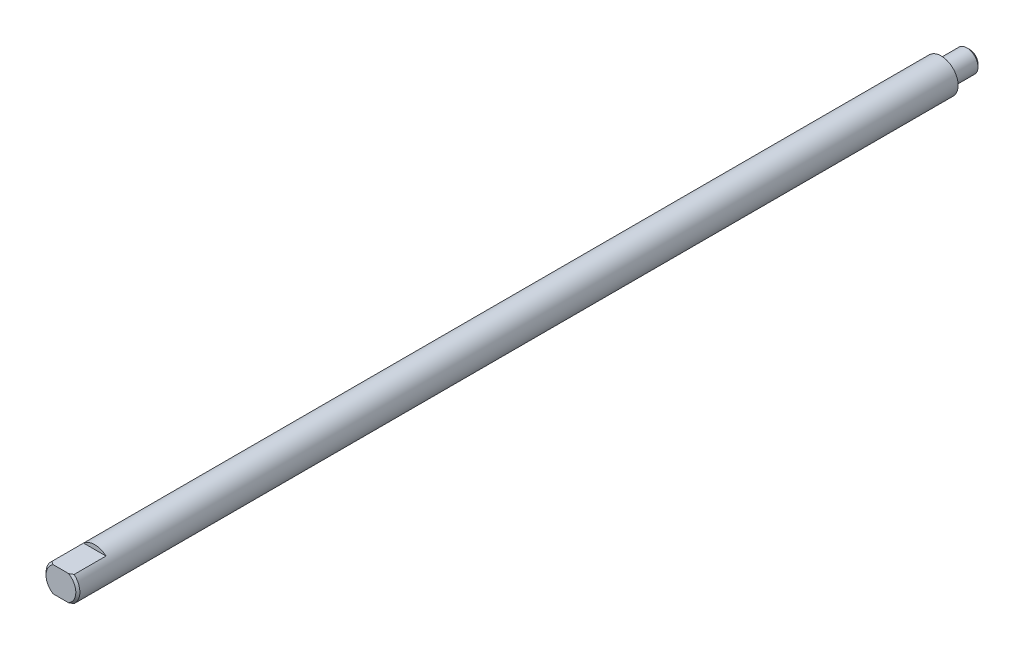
ISO-10303-21;
HEADER;
FILE_DESCRIPTION(('STEP AP214'),'2;1');
FILE_NAME('part.step','',(''),(''),'','','');
FILE_SCHEMA(('AUTOMOTIVE_DESIGN { 1 0 10303 214 1 1 1 1 }'));
ENDSEC;
DATA;
#1=APPLICATION_CONTEXT('core data for automotive mechanical design processes');
#2=APPLICATION_PROTOCOL_DEFINITION('international standard','automotive_design',2000,#1);
#3=PRODUCT_CONTEXT('',#1,'mechanical');
#4=PRODUCT('Part','Part','',(#3));
#5=PRODUCT_RELATED_PRODUCT_CATEGORY('part','',(#4));
#6=PRODUCT_DEFINITION_FORMATION('','',#4);
#7=PRODUCT_DEFINITION_CONTEXT('part definition',#1,'design');
#8=PRODUCT_DEFINITION('design','',#6,#7);
#9=PRODUCT_DEFINITION_SHAPE('','',#8);
#10=(LENGTH_UNIT() NAMED_UNIT(*) SI_UNIT(.MILLI.,.METRE.));
#11=(NAMED_UNIT(*) PLANE_ANGLE_UNIT() SI_UNIT($,.RADIAN.));
#12=(NAMED_UNIT(*) SI_UNIT($,.STERADIAN.) SOLID_ANGLE_UNIT());
#13=UNCERTAINTY_MEASURE_WITH_UNIT(LENGTH_MEASURE(1.E-05),#10,'distance_accuracy_value','');
#14=(GEOMETRIC_REPRESENTATION_CONTEXT(3) GLOBAL_UNCERTAINTY_ASSIGNED_CONTEXT((#13)) GLOBAL_UNIT_ASSIGNED_CONTEXT((#10,
#11,#12)) REPRESENTATION_CONTEXT('',''));
#15=CARTESIAN_POINT('',(0.,0.,0.));
#16=DIRECTION('',(0.,0.,1.));
#17=DIRECTION('',(1.,0.,0.));
#18=AXIS2_PLACEMENT_3D('',#15,#16,#17);
#19=CARTESIAN_POINT('',(0.,0.,3.684));
#20=DIRECTION('',(0.,0.,-1.));
#21=DIRECTION('',(-1.,0.,0.));
#22=AXIS2_PLACEMENT_3D('',#19,#20,#21);
#23=CONICAL_SURFACE('',#22,3.175,0.791934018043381);
#24=CARTESIAN_POINT('',(0.,0.,3.684));
#25=DIRECTION('',(0.,0.,1.));
#26=DIRECTION('',(1.,0.,0.));
#27=AXIS2_PLACEMENT_3D('',#24,#25,#26);
#28=CIRCLE('',#27,3.175);
#29=CARTESIAN_POINT('',(-2.10713075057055,2.375,3.684));
#30=VERTEX_POINT('',#29);
#31=CARTESIAN_POINT('',(-2.10713075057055,-2.375,3.684));
#32=VERTEX_POINT('',#31);
#33=EDGE_CURVE('E105',#30,#32,#28,.T.);
#34=ORIENTED_EDGE('',*,*,#33,.T.);
#35=CARTESIAN_POINT('',(-6.6296694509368,-2.375,-0.13301595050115));
#36=CARTESIAN_POINT('',(-6.41872085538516,-2.375,0.062936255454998));
#37=CARTESIAN_POINT('',(-6.20729327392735,-2.375,0.258380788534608));
#38=CARTESIAN_POINT('',(-5.78286017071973,-2.375,0.647887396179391));
#39=CARTESIAN_POINT('',(-5.56985352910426,-2.375,0.841948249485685));
#40=CARTESIAN_POINT('',(-5.13574053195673,-2.375,1.23363349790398));
#41=CARTESIAN_POINT('',(-4.9145790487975,-2.375,1.43119690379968));
#42=CARTESIAN_POINT('',(-4.46963283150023,-2.375,1.82304516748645));
#43=CARTESIAN_POINT('',(-4.24585006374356,-2.375,2.01733224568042));
#44=CARTESIAN_POINT('',(-3.90719638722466,-2.375,2.30510248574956));
#45=CARTESIAN_POINT('',(-3.79385459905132,-2.375,2.40038380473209));
#46=CARTESIAN_POINT('',(-3.56590809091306,-2.375,2.5894215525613));
#47=CARTESIAN_POINT('',(-3.4513034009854,-2.375,2.68317801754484));
#48=CARTESIAN_POINT('',(-3.22025369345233,-2.375,2.86895465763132));
#49=CARTESIAN_POINT('',(-3.10380502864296,-2.375,2.96097030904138));
#50=CARTESIAN_POINT('',(-2.86892224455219,-2.375,3.14241965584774));
#51=CARTESIAN_POINT('',(-2.75048831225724,-2.375,3.23185359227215));
#52=CARTESIAN_POINT('',(-2.51255729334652,-2.375,3.40617108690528));
#53=CARTESIAN_POINT('',(-2.39309165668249,-2.375,3.49109735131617));
#54=CARTESIAN_POINT('',(-2.15090508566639,-2.375,3.65634247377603));
#55=CARTESIAN_POINT('',(-2.02818269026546,-2.375,3.73665921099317));
#56=CARTESIAN_POINT('',(-1.77912466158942,-2.375,3.8903965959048));
#57=CARTESIAN_POINT('',(-1.65280524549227,-2.375,3.96384327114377));
#58=CARTESIAN_POINT('',(-1.39512518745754,-2.375,4.10119391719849));
#59=CARTESIAN_POINT('',(-1.26377071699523,-2.375,4.16510912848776));
#60=CARTESIAN_POINT('',(-1.05701971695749,-2.375,4.25273595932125));
#61=CARTESIAN_POINT('',(-0.983728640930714,-2.375,4.28140199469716));
#62=CARTESIAN_POINT('',(-0.835356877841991,-2.375,4.3337772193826));
#63=CARTESIAN_POINT('',(-0.760275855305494,-2.375,4.35748547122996));
#64=CARTESIAN_POINT('',(-0.608898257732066,-2.375,4.39885359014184));
#65=CARTESIAN_POINT('',(-0.532610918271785,-2.375,4.41654679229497));
#66=CARTESIAN_POINT('',(-0.378780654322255,-2.375,4.445154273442));
#67=CARTESIAN_POINT('',(-0.301238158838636,-2.375,4.45607082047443));
#68=CARTESIAN_POINT('',(-0.144559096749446,-2.375,4.47054748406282));
#69=CARTESIAN_POINT('',(-0.065414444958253,-2.375,4.47402190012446));
#70=CARTESIAN_POINT('',(0.09282495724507,-2.375,4.47312081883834));
#71=CARTESIAN_POINT('',(0.171919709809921,-2.375,4.4687456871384));
#72=CARTESIAN_POINT('',(0.329626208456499,-2.375,4.45241265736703));
#73=CARTESIAN_POINT('',(0.408234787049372,-2.375,4.44042470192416));
#74=CARTESIAN_POINT('',(0.564086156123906,-2.375,4.40957980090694));
#75=CARTESIAN_POINT('',(0.641328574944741,-2.375,4.39072101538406));
#76=CARTESIAN_POINT('',(0.827865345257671,-2.375,4.33746225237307));
#77=CARTESIAN_POINT('',(0.936246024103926,-2.375,4.29987709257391));
#78=CARTESIAN_POINT('',(1.14927492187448,-2.375,4.21535984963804));
#79=CARTESIAN_POINT('',(1.25392057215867,-2.375,4.16842147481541));
#80=CARTESIAN_POINT('',(1.46087103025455,-2.375,4.06709514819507));
#81=CARTESIAN_POINT('',(1.56313950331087,-2.375,4.01263383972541));
#82=CARTESIAN_POINT('',(1.71427099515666,-2.375,3.92703840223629));
#83=CARTESIAN_POINT('',(1.76426245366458,-2.375,3.89786057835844));
#84=CARTESIAN_POINT('',(1.86356372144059,-2.375,3.83837009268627));
#85=CARTESIAN_POINT('',(1.91287355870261,-2.375,3.80805747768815));
#86=CARTESIAN_POINT('',(2.07522042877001,-2.375,3.7060122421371));
#87=CARTESIAN_POINT('',(2.18692206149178,-2.375,3.63215349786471));
#88=CARTESIAN_POINT('',(2.40772318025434,-2.375,3.48062951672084));
#89=CARTESIAN_POINT('',(2.51682205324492,-2.375,3.40296339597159));
#90=CARTESIAN_POINT('',(2.73301390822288,-2.375,3.24473477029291));
#91=CARTESIAN_POINT('',(2.84010537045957,-2.375,3.16417019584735));
#92=CARTESIAN_POINT('',(3.05261723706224,-2.375,3.00086187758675));
#93=CARTESIAN_POINT('',(3.15803753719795,-2.375,2.91811799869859));
#94=CARTESIAN_POINT('',(3.47300086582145,-2.375,2.66679989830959));
#95=CARTESIAN_POINT('',(3.68051445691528,-2.375,2.49568568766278));
#96=CARTESIAN_POINT('',(4.09182405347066,-2.375,2.14926116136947));
#97=CARTESIAN_POINT('',(4.29562161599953,-2.375,1.97395267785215));
#98=CARTESIAN_POINT('',(4.67931232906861,-2.375,1.63905531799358));
#99=CARTESIAN_POINT('',(4.85946034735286,-2.375,1.47975783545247));
#100=CARTESIAN_POINT('',(5.21824582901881,-2.375,1.15942835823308));
#101=CARTESIAN_POINT('',(5.39688309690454,-2.375,0.998396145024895));
#102=CARTESIAN_POINT('',(5.75173692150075,-2.375,0.676174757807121));
#103=CARTESIAN_POINT('',(5.9279616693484,-2.375,0.514994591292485));
#104=CARTESIAN_POINT('',(6.2794614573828,-2.375,0.19165934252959));
#105=CARTESIAN_POINT('',(6.45473664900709,-2.375,0.0295044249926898));
#106=CARTESIAN_POINT('',(6.6296694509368,-2.375,-0.133015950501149));
#107=B_SPLINE_CURVE_WITH_KNOTS('',3,(#35,#36,#37,#38,#39,#40,#41,#42,#43,#44,#45,#46,#47,#48,
#49,#50,#51,#52,#53,#54,#55,#56,#57,#58,#59,#60,#61,#62,#63,#64,#65,#66,#67,#68,#69,#70,#71,#72,
#73,#74,#75,#76,#77,#78,#79,#80,#81,#82,#83,#84,#85,#86,#87,#88,#89,#90,#91,#92,#93,#94,#95,#96,
#97,#98,#99,#100,#101,#102,#103,#104,#105,#106),.UNSPECIFIED.,.F.,.F.,(4,2,2,2,2,2,2,2,2,2,2,2,
2,2,2,2,2,2,2,2,2,2,2,2,2,2,2,2,2,2,2,2,2,2,2,4),(0.,0.863760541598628,1.72820709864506,
2.61784876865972,3.50686109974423,3.95106286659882,4.39525409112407,4.84047397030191,
5.28565214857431,5.72530383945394,6.16515621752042,6.60326828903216,7.04085953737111,
7.27681206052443,7.51280915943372,7.74747620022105,7.98206465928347,8.21934033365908,
8.45660495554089,8.69481223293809,8.93308334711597,9.2766060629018,9.62036064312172,
9.96774119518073,10.141380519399,10.315012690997,10.7166254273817,11.1183318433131,
11.5203310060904,11.9223551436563,12.7291420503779,13.5355827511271,14.2569976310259,
14.978504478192,15.6949553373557,16.4112883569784),.UNSPECIFIED.);
#108=CARTESIAN_POINT('',(-1.46406113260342,-2.375,4.064));
#109=VERTEX_POINT('',#108);
#110=EDGE_CURVE('E128',#32,#109,#107,.T.);
#111=ORIENTED_EDGE('',*,*,#110,.T.);
#112=CARTESIAN_POINT('',(0.,0.,4.064));
#113=DIRECTION('',(0.,0.,1.));
#114=DIRECTION('',(1.,0.,0.));
#115=AXIS2_PLACEMENT_3D('',#112,#113,#114);
#116=CIRCLE('',#115,2.79);
#117=CARTESIAN_POINT('',(-1.46406113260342,2.375,4.064));
#118=VERTEX_POINT('',#117);
#119=EDGE_CURVE('E115',#118,#109,#116,.T.);
#120=ORIENTED_EDGE('',*,*,#119,.F.);
#121=CARTESIAN_POINT('',(6.6296694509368,2.375,-0.13301595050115));
#122=CARTESIAN_POINT('',(6.41872085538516,2.375,0.0629362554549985));
#123=CARTESIAN_POINT('',(6.20729327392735,2.375,0.258380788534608));
#124=CARTESIAN_POINT('',(5.78286017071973,2.375,0.647887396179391));
#125=CARTESIAN_POINT('',(5.56985352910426,2.375,0.841948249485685));
#126=CARTESIAN_POINT('',(5.13574053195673,2.375,1.23363349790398));
#127=CARTESIAN_POINT('',(4.9145790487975,2.375,1.43119690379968));
#128=CARTESIAN_POINT('',(4.46963283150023,2.375,1.82304516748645));
#129=CARTESIAN_POINT('',(4.24585006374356,2.375,2.01733224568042));
#130=CARTESIAN_POINT('',(3.90719638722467,2.375,2.30510248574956));
#131=CARTESIAN_POINT('',(3.79385459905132,2.375,2.40038380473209));
#132=CARTESIAN_POINT('',(3.56590809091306,2.375,2.5894215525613));
#133=CARTESIAN_POINT('',(3.4513034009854,2.375,2.68317801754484));
#134=CARTESIAN_POINT('',(3.22025369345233,2.375,2.86895465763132));
#135=CARTESIAN_POINT('',(3.10380502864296,2.375,2.96097030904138));
#136=CARTESIAN_POINT('',(2.86892224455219,2.375,3.14241965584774));
#137=CARTESIAN_POINT('',(2.75048831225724,2.375,3.23185359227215));
#138=CARTESIAN_POINT('',(2.51255729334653,2.375,3.40617108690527));
#139=CARTESIAN_POINT('',(2.3930916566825,2.375,3.49109735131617));
#140=CARTESIAN_POINT('',(2.15090508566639,2.375,3.65634247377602));
#141=CARTESIAN_POINT('',(2.02818269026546,2.375,3.73665921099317));
#142=CARTESIAN_POINT('',(1.77912466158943,2.375,3.8903965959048));
#143=CARTESIAN_POINT('',(1.65280524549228,2.375,3.96384327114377));
#144=CARTESIAN_POINT('',(1.39512518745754,2.375,4.10119391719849));
#145=CARTESIAN_POINT('',(1.26377071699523,2.375,4.16510912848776));
#146=CARTESIAN_POINT('',(1.0570197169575,2.375,4.25273595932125));
#147=CARTESIAN_POINT('',(0.983728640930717,2.375,4.28140199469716));
#148=CARTESIAN_POINT('',(0.835356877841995,2.375,4.3337772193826));
#149=CARTESIAN_POINT('',(0.760275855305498,2.375,4.35748547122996));
#150=CARTESIAN_POINT('',(0.608898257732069,2.375,4.39885359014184));
#151=CARTESIAN_POINT('',(0.532610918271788,2.375,4.41654679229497));
#152=CARTESIAN_POINT('',(0.378780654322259,2.375,4.445154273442));
#153=CARTESIAN_POINT('',(0.301238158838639,2.375,4.45607082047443));
#154=CARTESIAN_POINT('',(0.144559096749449,2.375,4.47054748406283));
#155=CARTESIAN_POINT('',(0.0654144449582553,2.375,4.47402190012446));
#156=CARTESIAN_POINT('',(-0.0928249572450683,2.375,4.47312081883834));
#157=CARTESIAN_POINT('',(-0.171919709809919,2.375,4.4687456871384));
#158=CARTESIAN_POINT('',(-0.329626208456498,2.375,4.45241265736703));
#159=CARTESIAN_POINT('',(-0.408234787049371,2.375,4.44042470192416));
#160=CARTESIAN_POINT('',(-0.564086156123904,2.375,4.40957980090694));
#161=CARTESIAN_POINT('',(-0.641328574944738,2.375,4.39072101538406));
#162=CARTESIAN_POINT('',(-0.827865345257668,2.375,4.33746225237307));
#163=CARTESIAN_POINT('',(-0.936246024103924,2.375,4.29987709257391));
#164=CARTESIAN_POINT('',(-1.14927492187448,2.375,4.21535984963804));
#165=CARTESIAN_POINT('',(-1.25392057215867,2.375,4.16842147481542));
#166=CARTESIAN_POINT('',(-1.46087103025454,2.375,4.06709514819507));
#167=CARTESIAN_POINT('',(-1.56313950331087,2.375,4.01263383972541));
#168=CARTESIAN_POINT('',(-1.71427099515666,2.375,3.92703840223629));
#169=CARTESIAN_POINT('',(-1.76426245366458,2.375,3.89786057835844));
#170=CARTESIAN_POINT('',(-1.86356372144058,2.375,3.83837009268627));
#171=CARTESIAN_POINT('',(-1.91287355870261,2.375,3.80805747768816));
#172=CARTESIAN_POINT('',(-2.07522042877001,2.375,3.70601224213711));
#173=CARTESIAN_POINT('',(-2.18692206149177,2.375,3.63215349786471));
#174=CARTESIAN_POINT('',(-2.40772318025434,2.375,3.48062951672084));
#175=CARTESIAN_POINT('',(-2.51682205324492,2.375,3.40296339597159));
#176=CARTESIAN_POINT('',(-2.73301390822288,2.375,3.24473477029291));
#177=CARTESIAN_POINT('',(-2.84010537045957,2.375,3.16417019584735));
#178=CARTESIAN_POINT('',(-3.05261723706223,2.375,3.00086187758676));
#179=CARTESIAN_POINT('',(-3.15803753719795,2.375,2.91811799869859));
#180=CARTESIAN_POINT('',(-3.47300086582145,2.375,2.66679989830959));
#181=CARTESIAN_POINT('',(-3.68051445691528,2.375,2.49568568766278));
#182=CARTESIAN_POINT('',(-4.09182405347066,2.375,2.14926116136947));
#183=CARTESIAN_POINT('',(-4.29562161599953,2.375,1.97395267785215));
#184=CARTESIAN_POINT('',(-4.67931232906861,2.375,1.63905531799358));
#185=CARTESIAN_POINT('',(-4.85946034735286,2.375,1.47975783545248));
#186=CARTESIAN_POINT('',(-5.2182458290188,2.375,1.15942835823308));
#187=CARTESIAN_POINT('',(-5.39688309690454,2.375,0.998396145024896));
#188=CARTESIAN_POINT('',(-5.75173692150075,2.375,0.676174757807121));
#189=CARTESIAN_POINT('',(-5.9279616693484,2.375,0.514994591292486));
#190=CARTESIAN_POINT('',(-6.2794614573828,2.375,0.19165934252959));
#191=CARTESIAN_POINT('',(-6.45473664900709,2.375,0.0295044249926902));
#192=CARTESIAN_POINT('',(-6.6296694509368,2.375,-0.133015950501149));
#193=B_SPLINE_CURVE_WITH_KNOTS('',3,(#121,#122,#123,#124,#125,#126,#127,#128,#129,#130,#131,
#132,#133,#134,#135,#136,#137,#138,#139,#140,#141,#142,#143,#144,#145,#146,#147,#148,#149,#150,
#151,#152,#153,#154,#155,#156,#157,#158,#159,#160,#161,#162,#163,#164,#165,#166,#167,#168,#169,
#170,#171,#172,#173,#174,#175,#176,#177,#178,#179,#180,#181,#182,#183,#184,#185,#186,#187,#188,
#189,#190,#191,#192),.UNSPECIFIED.,.F.,.F.,(4,2,2,2,2,2,2,2,2,2,2,2,2,2,2,2,2,2,2,2,2,2,2,2,2,2,
2,2,2,2,2,2,2,2,2,4),(0.,0.863760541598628,1.72820709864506,2.61784876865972,3.50686109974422,
3.95106286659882,4.39525409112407,4.8404739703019,5.28565214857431,5.72530383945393,
6.16515621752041,6.60326828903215,7.04085953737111,7.27681206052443,7.51280915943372,
7.74747620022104,7.98206465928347,8.21934033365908,8.45660495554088,8.69481223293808,
8.93308334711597,9.2766060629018,9.62036064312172,9.96774119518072,10.141380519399,
10.3150126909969,10.7166254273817,11.1183318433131,11.5203310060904,11.9223551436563,
12.7291420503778,13.5355827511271,14.2569976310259,14.978504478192,15.6949553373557,
16.4112883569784),.UNSPECIFIED.);
#194=EDGE_CURVE('E129',#118,#30,#193,.T.);
#195=ORIENTED_EDGE('',*,*,#194,.T.);
#196=EDGE_LOOP('',(#34,#111,#120,#195));
#197=FACE_BOUND('',#196,.T.);
#198=ADVANCED_FACE('F33',(#197),#23,.T.);
#199=CARTESIAN_POINT('',(0.,0.,4.064));
#200=DIRECTION('',(0.,0.,-1.));
#201=DIRECTION('',(-1.,0.,0.));
#202=AXIS2_PLACEMENT_3D('',#199,#200,#201);
#203=PLANE('',#202);
#204=ORIENTED_EDGE('',*,*,#119,.T.);
#205=DIRECTION('',(1.,0.,0.));
#206=VECTOR('',#205,1.);
#207=CARTESIAN_POINT('',(-5.,-2.375,4.064));
#208=LINE('',#207,#206);
#209=CARTESIAN_POINT('',(1.46406113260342,-2.375,4.064));
#210=VERTEX_POINT('',#209);
#211=EDGE_CURVE('E95',#109,#210,#208,.T.);
#212=ORIENTED_EDGE('',*,*,#211,.T.);
#213=CARTESIAN_POINT('',(1.46406113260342,2.375,4.064));
#214=VERTEX_POINT('',#213);
#215=EDGE_CURVE('E109',#210,#214,#116,.T.);
#216=ORIENTED_EDGE('',*,*,#215,.T.);
#217=DIRECTION('',(1.,0.,0.));
#218=VECTOR('',#217,1.);
#219=CARTESIAN_POINT('',(-5.,2.375,4.064));
#220=LINE('',#219,#218);
#221=EDGE_CURVE('E135',#118,#214,#220,.T.);
#222=ORIENTED_EDGE('',*,*,#221,.F.);
#223=EDGE_LOOP('',(#204,#212,#216,#222));
#224=FACE_BOUND('',#223,.T.);
#225=ADVANCED_FACE('F35',(#224),#203,.F.);
#226=ORIENTED_EDGE('',*,*,#215,.F.);
#227=CARTESIAN_POINT('',(2.10713075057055,-2.375,3.684));
#228=VERTEX_POINT('',#227);
#229=EDGE_CURVE('E94',#210,#228,#107,.T.);
#230=ORIENTED_EDGE('',*,*,#229,.T.);
#231=CARTESIAN_POINT('',(2.10713075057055,2.375,3.684));
#232=VERTEX_POINT('',#231);
#233=EDGE_CURVE('E101',#228,#232,#28,.T.);
#234=ORIENTED_EDGE('',*,*,#233,.T.);
#235=EDGE_CURVE('E132',#232,#214,#193,.T.);
#236=ORIENTED_EDGE('',*,*,#235,.T.);
#237=EDGE_LOOP('',(#226,#230,#234,#236));
#238=FACE_BOUND('',#237,.T.);
#239=ADVANCED_FACE('F144',(#238),#23,.T.);
#240=CARTESIAN_POINT('',(0.,0.,4.064));
#241=DIRECTION('',(0.,0.,1.));
#242=DIRECTION('',(1.,0.,0.));
#243=AXIS2_PLACEMENT_3D('',#240,#241,#242);
#244=CYLINDRICAL_SURFACE('',#243,3.175);
#245=ORIENTED_EDGE('',*,*,#233,.F.);
#246=DIRECTION('',(0.,0.,1.));
#247=VECTOR('',#246,1.);
#248=CARTESIAN_POINT('',(2.10713075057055,-2.375,4.064));
#249=LINE('',#248,#247);
#250=CARTESIAN_POINT('',(2.10713075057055,-2.375,-2.286));
#251=VERTEX_POINT('',#250);
#252=EDGE_CURVE('E11',#228,#251,#249,.F.);
#253=ORIENTED_EDGE('',*,*,#252,.T.);
#254=CARTESIAN_POINT('',(0.,0.,-2.28599999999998));
#255=DIRECTION('',(0.,0.,-1.));
#256=DIRECTION('',(0.,1.,0.));
#257=AXIS2_PLACEMENT_3D('',#254,#255,#256);
#258=CIRCLE('',#257,3.175);
#259=CARTESIAN_POINT('',(-2.10713075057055,-2.375,-2.286));
#260=VERTEX_POINT('',#259);
#261=EDGE_CURVE('E85',#251,#260,#258,.T.);
#262=ORIENTED_EDGE('',*,*,#261,.T.);
#263=DIRECTION('',(0.,0.,1.));
#264=VECTOR('',#263,1.);
#265=CARTESIAN_POINT('',(-2.10713075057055,-2.375,4.064));
#266=LINE('',#265,#264);
#267=EDGE_CURVE('E41',#260,#32,#266,.T.);
#268=ORIENTED_EDGE('',*,*,#267,.T.);
#269=ORIENTED_EDGE('',*,*,#33,.F.);
#270=DIRECTION('',(0.,0.,1.));
#271=VECTOR('',#270,1.);
#272=CARTESIAN_POINT('',(-2.10713075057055,2.375,4.064));
#273=LINE('',#272,#271);
#274=CARTESIAN_POINT('',(-2.10713075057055,2.375,-2.286));
#275=VERTEX_POINT('',#274);
#276=EDGE_CURVE('E118',#30,#275,#273,.F.);
#277=ORIENTED_EDGE('',*,*,#276,.T.);
#278=CARTESIAN_POINT('',(0.,0.,-2.28599999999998));
#279=DIRECTION('',(0.,0.,-1.));
#280=DIRECTION('',(0.,1.,0.));
#281=AXIS2_PLACEMENT_3D('',#278,#279,#280);
#282=CIRCLE('',#281,3.175);
#283=CARTESIAN_POINT('',(2.10713075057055,2.375,-2.286));
#284=VERTEX_POINT('',#283);
#285=EDGE_CURVE('E121',#275,#284,#282,.T.);
#286=ORIENTED_EDGE('',*,*,#285,.T.);
#287=DIRECTION('',(0.,0.,1.));
#288=VECTOR('',#287,1.);
#289=CARTESIAN_POINT('',(2.10713075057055,2.375,4.064));
#290=LINE('',#289,#288);
#291=EDGE_CURVE('E89',#284,#232,#290,.T.);
#292=ORIENTED_EDGE('',*,*,#291,.T.);
#293=EDGE_LOOP('',(#245,#253,#262,#268,#269,#277,#286,#292));
#294=FACE_BOUND('',#293,.T.);
#295=CARTESIAN_POINT('',(0.,0.,-161.036));
#296=DIRECTION('',(0.,0.,1.));
#297=DIRECTION('',(1.,0.,0.));
#298=AXIS2_PLACEMENT_3D('',#295,#296,#297);
#299=CIRCLE('',#298,3.175);
#300=CARTESIAN_POINT('',(3.175,0.,-161.036));
#301=VERTEX_POINT('',#300);
#302=EDGE_CURVE('E106',#301,#301,#299,.T.);
#303=ORIENTED_EDGE('',*,*,#302,.T.);
#304=EDGE_LOOP('',(#303));
#305=FACE_BOUND('',#304,.T.);
#306=ADVANCED_FACE('F98',(#294,#305),#244,.T.);
#307=CARTESIAN_POINT('',(0.,2.0828,-161.036));
#308=DIRECTION('',(0.,0.,1.));
#309=DIRECTION('',(1.,0.,0.));
#310=AXIS2_PLACEMENT_3D('',#307,#308,#309);
#311=PLANE('',#310);
#312=ORIENTED_EDGE('',*,*,#302,.F.);
#313=EDGE_LOOP('',(#312));
#314=FACE_BOUND('',#313,.T.);
#315=CARTESIAN_POINT('',(0.,0.,-161.036));
#316=DIRECTION('',(0.,0.,1.));
#317=DIRECTION('',(1.,0.,0.));
#318=AXIS2_PLACEMENT_3D('',#315,#316,#317);
#319=CIRCLE('',#318,2.0828);
#320=CARTESIAN_POINT('',(2.0828,0.,-161.036));
#321=VERTEX_POINT('',#320);
#322=EDGE_CURVE('E111',#321,#321,#319,.T.);
#323=ORIENTED_EDGE('',*,*,#322,.T.);
#324=EDGE_LOOP('',(#323));
#325=FACE_BOUND('',#324,.T.);
#326=ADVANCED_FACE('F165',(#314,#325),#311,.F.);
#327=CARTESIAN_POINT('',(0.,0.,4.064));
#328=DIRECTION('',(0.,0.,1.));
#329=DIRECTION('',(1.,0.,0.));
#330=AXIS2_PLACEMENT_3D('',#327,#328,#329);
#331=CYLINDRICAL_SURFACE('',#330,2.0828);
#332=ORIENTED_EDGE('',*,*,#322,.F.);
#333=EDGE_LOOP('',(#332));
#334=FACE_BOUND('',#333,.T.);
#335=CARTESIAN_POINT('',(0.,0.,-165.856));
#336=DIRECTION('',(0.,0.,1.));
#337=DIRECTION('',(1.,0.,0.));
#338=AXIS2_PLACEMENT_3D('',#335,#336,#337);
#339=CIRCLE('',#338,2.0828);
#340=CARTESIAN_POINT('',(2.0828,0.,-165.856));
#341=VERTEX_POINT('',#340);
#342=EDGE_CURVE('E263',#341,#341,#339,.T.);
#343=ORIENTED_EDGE('',*,*,#342,.T.);
#344=EDGE_LOOP('',(#343));
#345=FACE_BOUND('',#344,.T.);
#346=ADVANCED_FACE('F161',(#334,#345),#331,.T.);
#347=CARTESIAN_POINT('',(0.,0.,-166.366));
#348=DIRECTION('',(0.,0.,1.));
#349=DIRECTION('',(1.,0.,0.));
#350=AXIS2_PLACEMENT_3D('',#347,#348,#349);
#351=CONICAL_SURFACE('',#350,1.57280000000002,0.785398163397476);
#352=ORIENTED_EDGE('',*,*,#342,.F.);
#353=EDGE_LOOP('',(#352));
#354=FACE_BOUND('',#353,.T.);
#355=CARTESIAN_POINT('',(0.,0.,-166.366));
#356=DIRECTION('',(0.,0.,1.));
#357=DIRECTION('',(1.,0.,0.));
#358=AXIS2_PLACEMENT_3D('',#355,#356,#357);
#359=CIRCLE('',#358,1.57280000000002);
#360=CARTESIAN_POINT('',(1.57280000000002,0.,-166.366));
#361=VERTEX_POINT('',#360);
#362=EDGE_CURVE('E134',#361,#361,#359,.T.);
#363=ORIENTED_EDGE('',*,*,#362,.T.);
#364=EDGE_LOOP('',(#363));
#365=FACE_BOUND('',#364,.T.);
#366=ADVANCED_FACE('F157',(#354,#365),#351,.T.);
#367=CARTESIAN_POINT('',(0.,0.,-166.366));
#368=DIRECTION('',(0.,0.,1.));
#369=DIRECTION('',(1.,0.,0.));
#370=AXIS2_PLACEMENT_3D('',#367,#368,#369);
#371=PLANE('',#370);
#372=ORIENTED_EDGE('',*,*,#362,.F.);
#373=EDGE_LOOP('',(#372));
#374=FACE_BOUND('',#373,.T.);
#375=ADVANCED_FACE('F154',(#374),#371,.F.);
#376=CARTESIAN_POINT('',(-5.,2.375,-2.286));
#377=DIRECTION('',(0.,0.,-1.));
#378=DIRECTION('',(0.,1.,0.));
#379=AXIS2_PLACEMENT_3D('',#376,#377,#378);
#380=PLANE('',#379);
#381=ORIENTED_EDGE('',*,*,#285,.F.);
#382=DIRECTION('',(1.,0.,0.));
#383=VECTOR('',#382,1.);
#384=CARTESIAN_POINT('',(-5.,2.375,-2.286));
#385=LINE('',#384,#383);
#386=EDGE_CURVE('E55',#275,#284,#385,.T.);
#387=ORIENTED_EDGE('',*,*,#386,.T.);
#388=EDGE_LOOP('',(#381,#387));
#389=FACE_BOUND('',#388,.T.);
#390=ADVANCED_FACE('F152',(#389),#380,.F.);
#391=CARTESIAN_POINT('',(-5.,2.375,4.064));
#392=DIRECTION('',(0.,-1.,0.));
#393=DIRECTION('',(0.,0.,-1.));
#394=AXIS2_PLACEMENT_3D('',#391,#392,#393);
#395=PLANE('',#394);
#396=ORIENTED_EDGE('',*,*,#291,.F.);
#397=ORIENTED_EDGE('',*,*,#386,.F.);
#398=ORIENTED_EDGE('',*,*,#276,.F.);
#399=ORIENTED_EDGE('',*,*,#194,.F.);
#400=ORIENTED_EDGE('',*,*,#221,.T.);
#401=ORIENTED_EDGE('',*,*,#235,.F.);
#402=EDGE_LOOP('',(#396,#397,#398,#399,#400,#401));
#403=FACE_BOUND('',#402,.T.);
#404=ADVANCED_FACE('F147',(#403),#395,.F.);
#405=CARTESIAN_POINT('',(-5.,-2.375,4.064));
#406=DIRECTION('',(0.,1.,0.));
#407=DIRECTION('',(0.,0.,1.));
#408=AXIS2_PLACEMENT_3D('',#405,#406,#407);
#409=PLANE('',#408);
#410=ORIENTED_EDGE('',*,*,#267,.F.);
#411=DIRECTION('',(1.,0.,0.));
#412=VECTOR('',#411,1.);
#413=CARTESIAN_POINT('',(-5.,-2.375,-2.286));
#414=LINE('',#413,#412);
#415=EDGE_CURVE('E47',#260,#251,#414,.T.);
#416=ORIENTED_EDGE('',*,*,#415,.T.);
#417=ORIENTED_EDGE('',*,*,#252,.F.);
#418=ORIENTED_EDGE('',*,*,#229,.F.);
#419=ORIENTED_EDGE('',*,*,#211,.F.);
#420=ORIENTED_EDGE('',*,*,#110,.F.);
#421=EDGE_LOOP('',(#410,#416,#417,#418,#419,#420));
#422=FACE_BOUND('',#421,.T.);
#423=ADVANCED_FACE('F92',(#422),#409,.F.);
#424=CARTESIAN_POINT('',(-5.,-2.375,-2.286));
#425=DIRECTION('',(0.,0.,-1.));
#426=DIRECTION('',(0.,1.,0.));
#427=AXIS2_PLACEMENT_3D('',#424,#425,#426);
#428=PLANE('',#427);
#429=ORIENTED_EDGE('',*,*,#415,.F.);
#430=ORIENTED_EDGE('',*,*,#261,.F.);
#431=EDGE_LOOP('',(#429,#430));
#432=FACE_BOUND('',#431,.T.);
#433=ADVANCED_FACE('F86',(#432),#428,.F.);
#434=CLOSED_SHELL('',(#198,#225,#239,#306,#326,#346,#366,#375,#390,#404,#423,#433));
#435=MANIFOLD_SOLID_BREP('B2',#434);
#436=ADVANCED_BREP_SHAPE_REPRESENTATION('',(#18,#435),#14);
#437=SHAPE_DEFINITION_REPRESENTATION(#9,#436);
ENDSEC;
END-ISO-10303-21;
